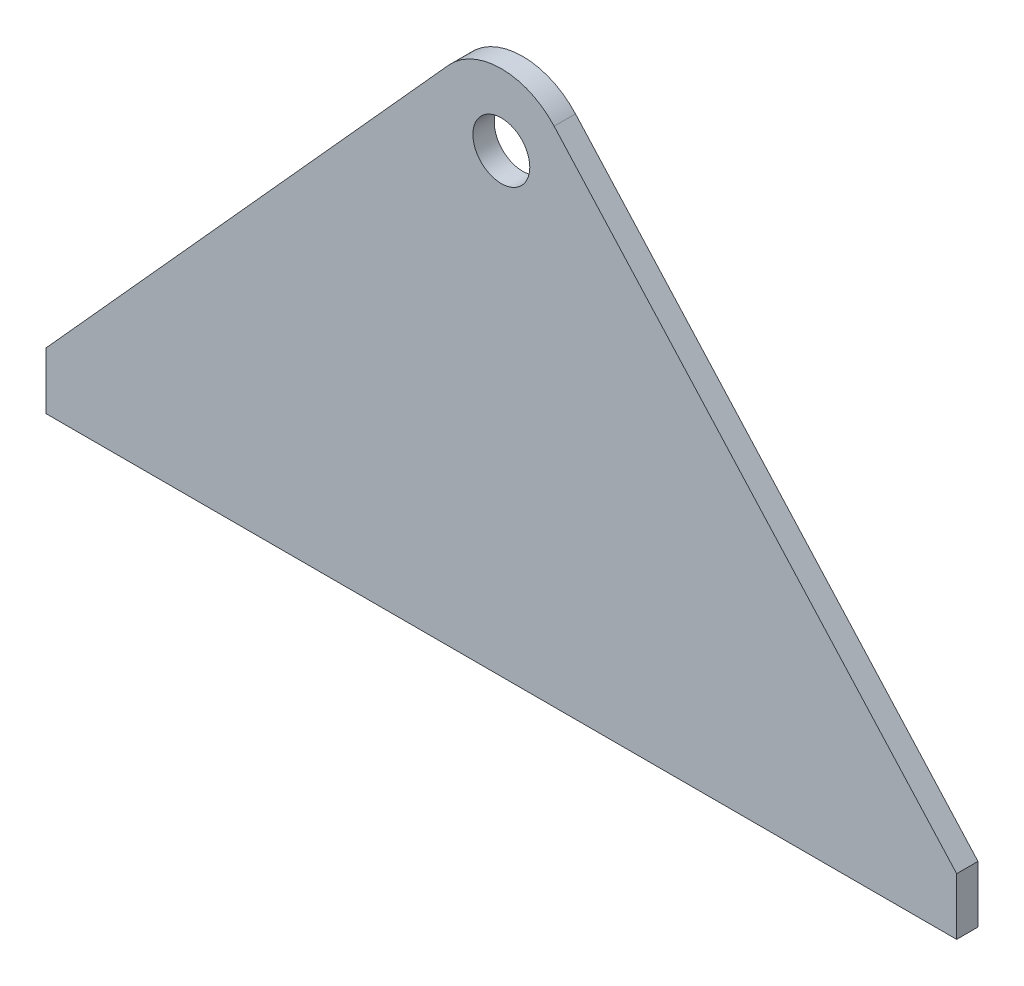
ISO-10303-21;
HEADER;
FILE_DESCRIPTION(('STEP AP214'),'2;1');
FILE_NAME('part.step','',(''),(''),'','','');
FILE_SCHEMA(('AUTOMOTIVE_DESIGN { 1 0 10303 214 1 1 1 1 }'));
ENDSEC;
DATA;
#1=APPLICATION_CONTEXT('core data for automotive mechanical design processes');
#2=APPLICATION_PROTOCOL_DEFINITION('international standard','automotive_design',2000,#1);
#3=PRODUCT_CONTEXT('',#1,'mechanical');
#4=PRODUCT('Part','Part','',(#3));
#5=PRODUCT_RELATED_PRODUCT_CATEGORY('part','',(#4));
#6=PRODUCT_DEFINITION_FORMATION('','',#4);
#7=PRODUCT_DEFINITION_CONTEXT('part definition',#1,'design');
#8=PRODUCT_DEFINITION('design','',#6,#7);
#9=PRODUCT_DEFINITION_SHAPE('','',#8);
#10=(LENGTH_UNIT() NAMED_UNIT(*) SI_UNIT(.MILLI.,.METRE.));
#11=(NAMED_UNIT(*) PLANE_ANGLE_UNIT() SI_UNIT($,.RADIAN.));
#12=(NAMED_UNIT(*) SI_UNIT($,.STERADIAN.) SOLID_ANGLE_UNIT());
#13=UNCERTAINTY_MEASURE_WITH_UNIT(LENGTH_MEASURE(1.E-05),#10,'distance_accuracy_value','');
#14=(GEOMETRIC_REPRESENTATION_CONTEXT(3) GLOBAL_UNCERTAINTY_ASSIGNED_CONTEXT((#13)) GLOBAL_UNIT_ASSIGNED_CONTEXT((#10,
#11,#12)) REPRESENTATION_CONTEXT('',''));
#15=CARTESIAN_POINT('',(0.,0.,0.));
#16=DIRECTION('',(0.,0.,1.));
#17=DIRECTION('',(1.,0.,0.));
#18=AXIS2_PLACEMENT_3D('',#15,#16,#17);
#19=CARTESIAN_POINT('',(-203.2,-203.2,-9.525));
#20=DIRECTION('',(-1.,0.,0.));
#21=DIRECTION('',(0.,0.,1.));
#22=AXIS2_PLACEMENT_3D('',#19,#20,#21);
#23=PLANE('',#22);
#24=DIRECTION('',(0.,-1.,0.));
#25=VECTOR('',#24,1.);
#26=CARTESIAN_POINT('',(-203.2,-203.2,0.));
#27=LINE('',#26,#25);
#28=CARTESIAN_POINT('',(-203.2,-177.8,0.));
#29=VERTEX_POINT('',#28);
#30=CARTESIAN_POINT('',(-203.2,-203.2,0.));
#31=VERTEX_POINT('',#30);
#32=EDGE_CURVE('E78',#29,#31,#27,.T.);
#33=ORIENTED_EDGE('',*,*,#32,.F.);
#34=DIRECTION('',(0.,0.,1.));
#35=VECTOR('',#34,1.);
#36=CARTESIAN_POINT('',(-203.2,-177.8,-9.525));
#37=LINE('',#36,#35);
#38=CARTESIAN_POINT('',(-203.2,-177.8,-9.525));
#39=VERTEX_POINT('',#38);
#40=EDGE_CURVE('E11',#39,#29,#37,.T.);
#41=ORIENTED_EDGE('',*,*,#40,.F.);
#42=DIRECTION('',(0.,-1.,0.));
#43=VECTOR('',#42,1.);
#44=CARTESIAN_POINT('',(-203.2,-203.2,-9.525));
#45=LINE('',#44,#43);
#46=CARTESIAN_POINT('',(-203.2,-203.2,-9.525));
#47=VERTEX_POINT('',#46);
#48=EDGE_CURVE('E80',#39,#47,#45,.T.);
#49=ORIENTED_EDGE('',*,*,#48,.T.);
#50=DIRECTION('',(0.,0.,1.));
#51=VECTOR('',#50,1.);
#52=CARTESIAN_POINT('',(-203.2,-203.2,-9.525));
#53=LINE('',#52,#51);
#54=EDGE_CURVE('E29',#47,#31,#53,.T.);
#55=ORIENTED_EDGE('',*,*,#54,.T.);
#56=EDGE_LOOP('',(#33,#41,#49,#55));
#57=FACE_BOUND('',#56,.T.);
#58=ADVANCED_FACE('F26',(#57),#23,.T.);
#59=CARTESIAN_POINT('',(-203.2,-177.8,-9.525));
#60=DIRECTION('',(-0.742431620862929,0.669921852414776,0.));
#61=DIRECTION('',(-0.669921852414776,-0.742431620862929,0.));
#62=AXIS2_PLACEMENT_3D('',#59,#60,#61);
#63=PLANE('',#62);
#64=DIRECTION('',(-0.669921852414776,-0.742431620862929,0.));
#65=VECTOR('',#64,1.);
#66=CARTESIAN_POINT('',(-203.2,-177.8,0.));
#67=LINE('',#66,#65);
#68=CARTESIAN_POINT('',(-23.572203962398,21.2700188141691,0.));
#69=VERTEX_POINT('',#68);
#70=EDGE_CURVE('E96',#69,#29,#67,.T.);
#71=ORIENTED_EDGE('',*,*,#70,.F.);
#72=DIRECTION('',(0.,0.,1.));
#73=VECTOR('',#72,1.);
#74=CARTESIAN_POINT('',(-23.572203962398,21.2700188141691,-9.525));
#75=LINE('',#74,#73);
#76=CARTESIAN_POINT('',(-23.572203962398,21.2700188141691,-9.525));
#77=VERTEX_POINT('',#76);
#78=EDGE_CURVE('E34',#77,#69,#75,.T.);
#79=ORIENTED_EDGE('',*,*,#78,.F.);
#80=DIRECTION('',(-0.669921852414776,-0.742431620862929,0.));
#81=VECTOR('',#80,1.);
#82=CARTESIAN_POINT('',(-203.2,-177.8,-9.525));
#83=LINE('',#82,#81);
#84=EDGE_CURVE('E85',#77,#39,#83,.T.);
#85=ORIENTED_EDGE('',*,*,#84,.T.);
#86=ORIENTED_EDGE('',*,*,#40,.T.);
#87=EDGE_LOOP('',(#71,#79,#85,#86));
#88=FACE_BOUND('',#87,.T.);
#89=ADVANCED_FACE('F136',(#88),#63,.T.);
#90=CARTESIAN_POINT('',(0.,0.,-9.525));
#91=DIRECTION('',(0.,0.,1.));
#92=DIRECTION('',(1.,0.,0.));
#93=AXIS2_PLACEMENT_3D('',#90,#91,#92);
#94=CYLINDRICAL_SURFACE('',#93,31.75);
#95=CARTESIAN_POINT('',(0.,0.,0.));
#96=DIRECTION('',(0.,0.,1.));
#97=DIRECTION('',(1.,0.,0.));
#98=AXIS2_PLACEMENT_3D('',#95,#96,#97);
#99=CIRCLE('',#98,31.75);
#100=CARTESIAN_POINT('',(23.572203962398,21.2700188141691,0.));
#101=VERTEX_POINT('',#100);
#102=EDGE_CURVE('E108',#101,#69,#99,.T.);
#103=ORIENTED_EDGE('',*,*,#102,.F.);
#104=DIRECTION('',(0.,0.,1.));
#105=VECTOR('',#104,1.);
#106=CARTESIAN_POINT('',(23.572203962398,21.2700188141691,-9.525));
#107=LINE('',#106,#105);
#108=CARTESIAN_POINT('',(23.572203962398,21.2700188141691,-9.525));
#109=VERTEX_POINT('',#108);
#110=EDGE_CURVE('E124',#109,#101,#107,.T.);
#111=ORIENTED_EDGE('',*,*,#110,.F.);
#112=CARTESIAN_POINT('',(0.,0.,-9.525));
#113=DIRECTION('',(0.,0.,1.));
#114=DIRECTION('',(1.,0.,0.));
#115=AXIS2_PLACEMENT_3D('',#112,#113,#114);
#116=CIRCLE('',#115,31.75);
#117=EDGE_CURVE('E120',#109,#77,#116,.T.);
#118=ORIENTED_EDGE('',*,*,#117,.T.);
#119=ORIENTED_EDGE('',*,*,#78,.T.);
#120=EDGE_LOOP('',(#103,#111,#118,#119));
#121=FACE_BOUND('',#120,.T.);
#122=ADVANCED_FACE('F141',(#121),#94,.T.);
#123=CARTESIAN_POINT('',(203.2,-177.8,-9.525));
#124=DIRECTION('',(0.742431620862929,0.669921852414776,0.));
#125=DIRECTION('',(-0.669921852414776,0.742431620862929,0.));
#126=AXIS2_PLACEMENT_3D('',#123,#124,#125);
#127=PLANE('',#126);
#128=DIRECTION('',(-0.669921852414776,0.742431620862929,0.));
#129=VECTOR('',#128,1.);
#130=CARTESIAN_POINT('',(203.2,-177.8,0.));
#131=LINE('',#130,#129);
#132=CARTESIAN_POINT('',(203.2,-177.8,0.));
#133=VERTEX_POINT('',#132);
#134=EDGE_CURVE('E105',#133,#101,#131,.T.);
#135=ORIENTED_EDGE('',*,*,#134,.F.);
#136=DIRECTION('',(0.,0.,1.));
#137=VECTOR('',#136,1.);
#138=CARTESIAN_POINT('',(203.2,-177.8,-9.525));
#139=LINE('',#138,#137);
#140=CARTESIAN_POINT('',(203.2,-177.8,-9.525));
#141=VERTEX_POINT('',#140);
#142=EDGE_CURVE('E126',#141,#133,#139,.T.);
#143=ORIENTED_EDGE('',*,*,#142,.F.);
#144=DIRECTION('',(-0.669921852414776,0.742431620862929,0.));
#145=VECTOR('',#144,1.);
#146=CARTESIAN_POINT('',(203.2,-177.8,-9.525));
#147=LINE('',#146,#145);
#148=EDGE_CURVE('E117',#141,#109,#147,.T.);
#149=ORIENTED_EDGE('',*,*,#148,.T.);
#150=ORIENTED_EDGE('',*,*,#110,.T.);
#151=EDGE_LOOP('',(#135,#143,#149,#150));
#152=FACE_BOUND('',#151,.T.);
#153=ADVANCED_FACE('F133',(#152),#127,.T.);
#154=CARTESIAN_POINT('',(203.2,-203.2,-9.525));
#155=DIRECTION('',(1.,0.,0.));
#156=DIRECTION('',(0.,0.,-1.));
#157=AXIS2_PLACEMENT_3D('',#154,#155,#156);
#158=PLANE('',#157);
#159=DIRECTION('',(0.,1.,0.));
#160=VECTOR('',#159,1.);
#161=CARTESIAN_POINT('',(203.2,-203.2,0.));
#162=LINE('',#161,#160);
#163=CARTESIAN_POINT('',(203.2,-203.2,0.));
#164=VERTEX_POINT('',#163);
#165=EDGE_CURVE('E92',#164,#133,#162,.T.);
#166=ORIENTED_EDGE('',*,*,#165,.F.);
#167=DIRECTION('',(0.,0.,1.));
#168=VECTOR('',#167,1.);
#169=CARTESIAN_POINT('',(203.2,-203.2,-9.525));
#170=LINE('',#169,#168);
#171=CARTESIAN_POINT('',(203.2,-203.2,-9.525));
#172=VERTEX_POINT('',#171);
#173=EDGE_CURVE('E84',#172,#164,#170,.T.);
#174=ORIENTED_EDGE('',*,*,#173,.F.);
#175=DIRECTION('',(0.,1.,0.));
#176=VECTOR('',#175,1.);
#177=CARTESIAN_POINT('',(203.2,-203.2,-9.525));
#178=LINE('',#177,#176);
#179=EDGE_CURVE('E114',#172,#141,#178,.T.);
#180=ORIENTED_EDGE('',*,*,#179,.T.);
#181=ORIENTED_EDGE('',*,*,#142,.T.);
#182=EDGE_LOOP('',(#166,#174,#180,#181));
#183=FACE_BOUND('',#182,.T.);
#184=ADVANCED_FACE('F129',(#183),#158,.T.);
#185=CARTESIAN_POINT('',(-203.2,-203.2,-9.525));
#186=DIRECTION('',(0.,-1.,0.));
#187=DIRECTION('',(0.,0.,-1.));
#188=AXIS2_PLACEMENT_3D('',#185,#186,#187);
#189=PLANE('',#188);
#190=DIRECTION('',(1.,0.,0.));
#191=VECTOR('',#190,1.);
#192=CARTESIAN_POINT('',(-203.2,-203.2,0.));
#193=LINE('',#192,#191);
#194=EDGE_CURVE('E87',#31,#164,#193,.T.);
#195=ORIENTED_EDGE('',*,*,#194,.F.);
#196=ORIENTED_EDGE('',*,*,#54,.F.);
#197=DIRECTION('',(1.,0.,0.));
#198=VECTOR('',#197,1.);
#199=CARTESIAN_POINT('',(-203.2,-203.2,-9.525));
#200=LINE('',#199,#198);
#201=EDGE_CURVE('E112',#47,#172,#200,.T.);
#202=ORIENTED_EDGE('',*,*,#201,.T.);
#203=ORIENTED_EDGE('',*,*,#173,.T.);
#204=EDGE_LOOP('',(#195,#196,#202,#203));
#205=FACE_BOUND('',#204,.T.);
#206=ADVANCED_FACE('F88',(#205),#189,.T.);
#207=CARTESIAN_POINT('',(0.,0.,-9.525));
#208=DIRECTION('',(0.,0.,1.));
#209=DIRECTION('',(1.,0.,0.));
#210=AXIS2_PLACEMENT_3D('',#207,#208,#209);
#211=PLANE('',#210);
#212=CARTESIAN_POINT('',(0.,0.,-9.525));
#213=DIRECTION('',(0.,0.,1.));
#214=DIRECTION('',(1.,0.,0.));
#215=AXIS2_PLACEMENT_3D('',#212,#213,#214);
#216=CIRCLE('',#215,12.7);
#217=CARTESIAN_POINT('',(12.7,0.,-9.525));
#218=VERTEX_POINT('',#217);
#219=EDGE_CURVE('E97',#218,#218,#216,.T.);
#220=ORIENTED_EDGE('',*,*,#219,.T.);
#221=EDGE_LOOP('',(#220));
#222=FACE_BOUND('',#221,.T.);
#223=ORIENTED_EDGE('',*,*,#48,.F.);
#224=ORIENTED_EDGE('',*,*,#84,.F.);
#225=ORIENTED_EDGE('',*,*,#117,.F.);
#226=ORIENTED_EDGE('',*,*,#148,.F.);
#227=ORIENTED_EDGE('',*,*,#179,.F.);
#228=ORIENTED_EDGE('',*,*,#201,.F.);
#229=EDGE_LOOP('',(#223,#224,#225,#226,#227,#228));
#230=FACE_BOUND('',#229,.T.);
#231=ADVANCED_FACE('F140',(#222,#230),#211,.F.);
#232=CARTESIAN_POINT('',(0.,0.,0.));
#233=DIRECTION('',(0.,0.,1.));
#234=DIRECTION('',(1.,0.,0.));
#235=AXIS2_PLACEMENT_3D('',#232,#233,#234);
#236=PLANE('',#235);
#237=CARTESIAN_POINT('',(0.,0.,0.));
#238=DIRECTION('',(0.,0.,1.));
#239=DIRECTION('',(1.,0.,0.));
#240=AXIS2_PLACEMENT_3D('',#237,#238,#239);
#241=CIRCLE('',#240,12.7);
#242=CARTESIAN_POINT('',(12.7,0.,0.));
#243=VERTEX_POINT('',#242);
#244=EDGE_CURVE('E100',#243,#243,#241,.T.);
#245=ORIENTED_EDGE('',*,*,#244,.F.);
#246=EDGE_LOOP('',(#245));
#247=FACE_BOUND('',#246,.T.);
#248=ORIENTED_EDGE('',*,*,#32,.T.);
#249=ORIENTED_EDGE('',*,*,#194,.T.);
#250=ORIENTED_EDGE('',*,*,#165,.T.);
#251=ORIENTED_EDGE('',*,*,#134,.T.);
#252=ORIENTED_EDGE('',*,*,#102,.T.);
#253=ORIENTED_EDGE('',*,*,#70,.T.);
#254=EDGE_LOOP('',(#248,#249,#250,#251,#252,#253));
#255=FACE_BOUND('',#254,.T.);
#256=ADVANCED_FACE('F94',(#247,#255),#236,.T.);
#257=CARTESIAN_POINT('',(0.,0.,-9.525));
#258=DIRECTION('',(0.,0.,1.));
#259=DIRECTION('',(1.,0.,0.));
#260=AXIS2_PLACEMENT_3D('',#257,#258,#259);
#261=CYLINDRICAL_SURFACE('',#260,12.7);
#262=CARTESIAN_POINT('',(12.7,0.,-9.525));
#263=CARTESIAN_POINT('',(12.7,0.,-9.42578125));
#264=CARTESIAN_POINT('',(12.7,0.,-9.3265625));
#265=CARTESIAN_POINT('',(12.7,0.,-9.128125));
#266=CARTESIAN_POINT('',(12.7,0.,-9.02890625));
#267=CARTESIAN_POINT('',(12.7,0.,-8.83046875));
#268=CARTESIAN_POINT('',(12.7,0.,-8.73125));
#269=CARTESIAN_POINT('',(12.7,0.,-8.5328125));
#270=CARTESIAN_POINT('',(12.7,0.,-8.43359375));
#271=CARTESIAN_POINT('',(12.7,0.,-8.23515625));
#272=CARTESIAN_POINT('',(12.7,0.,-8.1359375));
#273=CARTESIAN_POINT('',(12.7,0.,-7.9375));
#274=CARTESIAN_POINT('',(12.7,0.,-7.83828125));
#275=CARTESIAN_POINT('',(12.7,0.,-7.63984375));
#276=CARTESIAN_POINT('',(12.7,0.,-7.540625));
#277=CARTESIAN_POINT('',(12.7,0.,-7.3421875));
#278=CARTESIAN_POINT('',(12.7,0.,-7.24296875));
#279=CARTESIAN_POINT('',(12.7,0.,-7.04453125));
#280=CARTESIAN_POINT('',(12.7,0.,-6.9453125));
#281=CARTESIAN_POINT('',(12.7,0.,-6.746875));
#282=CARTESIAN_POINT('',(12.7,0.,-6.64765625));
#283=CARTESIAN_POINT('',(12.7,0.,-6.44921875));
#284=CARTESIAN_POINT('',(12.7,0.,-6.35));
#285=CARTESIAN_POINT('',(12.7,0.,-6.1515625));
#286=CARTESIAN_POINT('',(12.7,0.,-6.05234375));
#287=CARTESIAN_POINT('',(12.7,0.,-5.85390625));
#288=CARTESIAN_POINT('',(12.7,0.,-5.7546875));
#289=CARTESIAN_POINT('',(12.7,0.,-5.55625));
#290=CARTESIAN_POINT('',(12.7,0.,-5.45703125));
#291=CARTESIAN_POINT('',(12.7,0.,-5.25859375));
#292=CARTESIAN_POINT('',(12.7,0.,-5.159375));
#293=CARTESIAN_POINT('',(12.7,0.,-4.9609375));
#294=CARTESIAN_POINT('',(12.7,0.,-4.86171875));
#295=CARTESIAN_POINT('',(12.7,0.,-4.66328125));
#296=CARTESIAN_POINT('',(12.7,0.,-4.5640625));
#297=CARTESIAN_POINT('',(12.7,0.,-4.365625));
#298=CARTESIAN_POINT('',(12.7,0.,-4.26640625));
#299=CARTESIAN_POINT('',(12.7,0.,-4.06796875));
#300=CARTESIAN_POINT('',(12.7,0.,-3.96875));
#301=CARTESIAN_POINT('',(12.7,0.,-3.7703125));
#302=CARTESIAN_POINT('',(12.7,0.,-3.67109375));
#303=CARTESIAN_POINT('',(12.7,0.,-3.47265625));
#304=CARTESIAN_POINT('',(12.7,0.,-3.3734375));
#305=CARTESIAN_POINT('',(12.7,0.,-3.175));
#306=CARTESIAN_POINT('',(12.7,0.,-3.07578125));
#307=CARTESIAN_POINT('',(12.7,0.,-2.87734375));
#308=CARTESIAN_POINT('',(12.7,0.,-2.778125));
#309=CARTESIAN_POINT('',(12.7,0.,-2.5796875));
#310=CARTESIAN_POINT('',(12.7,0.,-2.48046875));
#311=CARTESIAN_POINT('',(12.7,0.,-2.28203125));
#312=CARTESIAN_POINT('',(12.7,0.,-2.1828125));
#313=CARTESIAN_POINT('',(12.7,0.,-1.984375));
#314=CARTESIAN_POINT('',(12.7,0.,-1.88515625));
#315=CARTESIAN_POINT('',(12.7,0.,-1.68671875));
#316=CARTESIAN_POINT('',(12.7,0.,-1.5875));
#317=CARTESIAN_POINT('',(12.7,0.,-1.3890625));
#318=CARTESIAN_POINT('',(12.7,0.,-1.28984375));
#319=CARTESIAN_POINT('',(12.7,0.,-1.09140625));
#320=CARTESIAN_POINT('',(12.7,0.,-0.992187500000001));
#321=CARTESIAN_POINT('',(12.7,0.,-0.793750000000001));
#322=CARTESIAN_POINT('',(12.7,0.,-0.69453125));
#323=CARTESIAN_POINT('',(12.7,0.,-0.49609375));
#324=CARTESIAN_POINT('',(12.7,0.,-0.396875));
#325=CARTESIAN_POINT('',(12.7,0.,-0.1984375));
#326=CARTESIAN_POINT('',(12.7,0.,-0.0992187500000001));
#327=CARTESIAN_POINT('',(12.7,0.,0.));
#328=B_SPLINE_CURVE_WITH_KNOTS('',3,(#262,#263,#264,#265,#266,#267,#268,#269,#270,#271,#272,
#273,#274,#275,#276,#277,#278,#279,#280,#281,#282,#283,#284,#285,#286,#287,#288,#289,#290,#291,
#292,#293,#294,#295,#296,#297,#298,#299,#300,#301,#302,#303,#304,#305,#306,#307,#308,#309,#310,
#311,#312,#313,#314,#315,#316,#317,#318,#319,#320,#321,#322,#323,#324,#325,#326,#327),
.UNSPECIFIED.,.F.,.F.,(4,2,2,2,2,2,2,2,2,2,2,2,2,2,2,2,2,2,2,2,2,2,2,2,2,2,2,2,2,2,2,2,4),(0.,
0.297656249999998,0.595312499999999,0.892968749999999,1.190625,1.48828125,1.7859375,2.08359375,
2.38125,2.67890625,2.9765625,3.27421875,3.571875,3.86953125,4.1671875,4.46484375,4.7625,
5.06015625,5.3578125,5.65546875,5.953125,6.25078125,6.5484375,6.84609375,7.14375,7.44140625,
7.7390625,8.03671875,8.334375,8.63203125,8.9296875,9.22734375,9.525),.UNSPECIFIED.);
#329=EDGE_CURVE('BSEAM188',#218,#243,#328,.T.);
#330=ORIENTED_EDGE('',*,*,#219,.F.);
#331=ORIENTED_EDGE('',*,*,#244,.T.);
#332=ORIENTED_EDGE('',*,*,#329,.T.);
#333=ORIENTED_EDGE('',*,*,#329,.F.);
#334=EDGE_LOOP('',(#330,#332,#331,#333));
#335=FACE_BOUND('',#334,.T.);
#336=ADVANCED_FACE('F188',(#335),#261,.F.);
#337=CLOSED_SHELL('',(#58,#89,#122,#153,#184,#206,#231,#256,#336));
#338=MANIFOLD_SOLID_BREP('B2',#337);
#339=ADVANCED_BREP_SHAPE_REPRESENTATION('',(#18,#338),#14);
#340=SHAPE_DEFINITION_REPRESENTATION(#9,#339);
ENDSEC;
END-ISO-10303-21;
